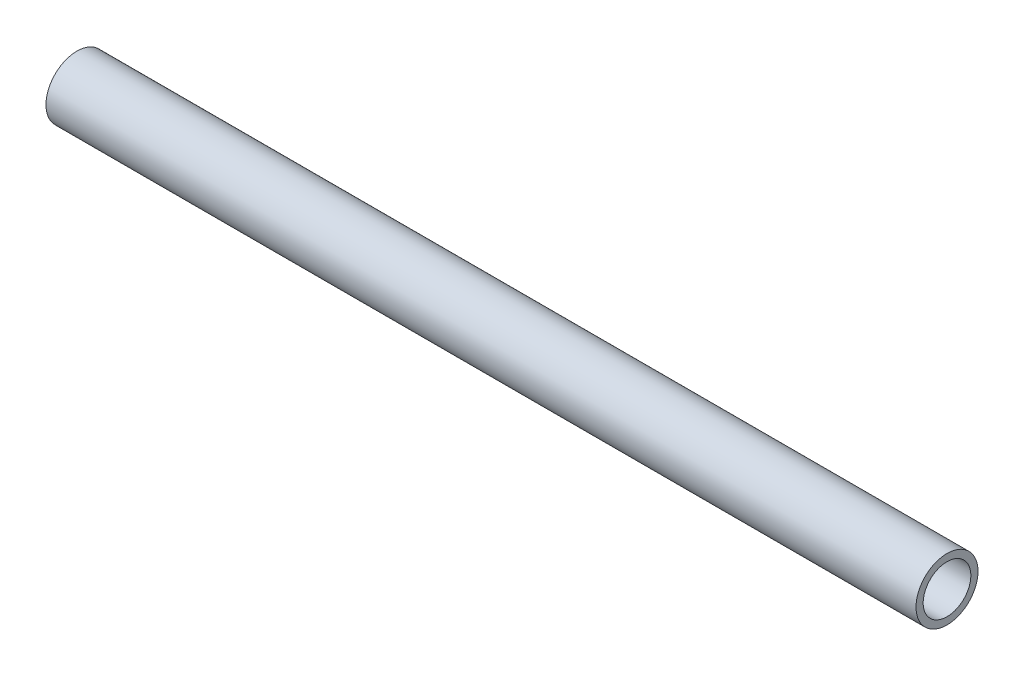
ISO-10303-21;
HEADER;
FILE_DESCRIPTION(('STEP AP214'),'2;1');
FILE_NAME('part.step','',(''),(''),'','','');
FILE_SCHEMA(('AUTOMOTIVE_DESIGN { 1 0 10303 214 1 1 1 1 }'));
ENDSEC;
DATA;
#1=APPLICATION_CONTEXT('core data for automotive mechanical design processes');
#2=APPLICATION_PROTOCOL_DEFINITION('international standard','automotive_design',2000,#1);
#3=PRODUCT_CONTEXT('',#1,'mechanical');
#4=PRODUCT('Part','Part','',(#3));
#5=PRODUCT_RELATED_PRODUCT_CATEGORY('part','',(#4));
#6=PRODUCT_DEFINITION_FORMATION('','',#4);
#7=PRODUCT_DEFINITION_CONTEXT('part definition',#1,'design');
#8=PRODUCT_DEFINITION('design','',#6,#7);
#9=PRODUCT_DEFINITION_SHAPE('','',#8);
#10=(LENGTH_UNIT() NAMED_UNIT(*) SI_UNIT(.MILLI.,.METRE.));
#11=(NAMED_UNIT(*) PLANE_ANGLE_UNIT() SI_UNIT($,.RADIAN.));
#12=(NAMED_UNIT(*) SI_UNIT($,.STERADIAN.) SOLID_ANGLE_UNIT());
#13=UNCERTAINTY_MEASURE_WITH_UNIT(LENGTH_MEASURE(1.E-05),#10,'distance_accuracy_value','');
#14=(GEOMETRIC_REPRESENTATION_CONTEXT(3) GLOBAL_UNCERTAINTY_ASSIGNED_CONTEXT((#13)) GLOBAL_UNIT_ASSIGNED_CONTEXT((#10,
#11,#12)) REPRESENTATION_CONTEXT('',''));
#15=CARTESIAN_POINT('',(0.,0.,0.));
#16=DIRECTION('',(0.,0.,1.));
#17=DIRECTION('',(1.,0.,0.));
#18=AXIS2_PLACEMENT_3D('',#15,#16,#17);
#19=CARTESIAN_POINT('',(463.55,0.,0.));
#20=DIRECTION('',(-1.,0.,0.));
#21=DIRECTION('',(0.,0.,1.));
#22=AXIS2_PLACEMENT_3D('',#19,#20,#21);
#23=CYLINDRICAL_SURFACE('',#22,12.7);
#24=CARTESIAN_POINT('',(463.55,0.,0.));
#25=DIRECTION('',(1.,0.,0.));
#26=DIRECTION('',(0.,0.,-1.));
#27=AXIS2_PLACEMENT_3D('',#24,#25,#26);
#28=CIRCLE('',#27,12.7);
#29=CARTESIAN_POINT('',(463.55,0.,-12.7));
#30=VERTEX_POINT('',#29);
#31=EDGE_CURVE('E45',#30,#30,#28,.T.);
#32=ORIENTED_EDGE('',*,*,#31,.T.);
#33=EDGE_LOOP('',(#32));
#34=FACE_BOUND('',#33,.T.);
#35=CARTESIAN_POINT('',(0.,0.,0.));
#36=DIRECTION('',(1.,0.,0.));
#37=DIRECTION('',(0.,0.,-1.));
#38=AXIS2_PLACEMENT_3D('',#35,#36,#37);
#39=CIRCLE('',#38,12.7);
#40=CARTESIAN_POINT('',(0.,0.,-12.7));
#41=VERTEX_POINT('',#40);
#42=EDGE_CURVE('E51',#41,#41,#39,.T.);
#43=ORIENTED_EDGE('',*,*,#42,.F.);
#44=EDGE_LOOP('',(#43));
#45=FACE_BOUND('',#44,.T.);
#46=ADVANCED_FACE('F38',(#34,#45),#23,.F.);
#47=CARTESIAN_POINT('',(463.55,0.,0.));
#48=DIRECTION('',(-1.,0.,0.));
#49=DIRECTION('',(0.,0.,1.));
#50=AXIS2_PLACEMENT_3D('',#47,#48,#49);
#51=CYLINDRICAL_SURFACE('',#50,16.51);
#52=CARTESIAN_POINT('',(463.55,0.,0.));
#53=DIRECTION('',(1.,0.,0.));
#54=DIRECTION('',(0.,0.,-1.));
#55=AXIS2_PLACEMENT_3D('',#52,#53,#54);
#56=CIRCLE('',#55,16.51);
#57=CARTESIAN_POINT('',(463.55,0.,-16.51));
#58=VERTEX_POINT('',#57);
#59=EDGE_CURVE('E10',#58,#58,#56,.T.);
#60=ORIENTED_EDGE('',*,*,#59,.F.);
#61=EDGE_LOOP('',(#60));
#62=FACE_BOUND('',#61,.T.);
#63=CARTESIAN_POINT('',(0.,0.,0.));
#64=DIRECTION('',(1.,0.,0.));
#65=DIRECTION('',(0.,0.,-1.));
#66=AXIS2_PLACEMENT_3D('',#63,#64,#65);
#67=CIRCLE('',#66,16.51);
#68=CARTESIAN_POINT('',(0.,0.,-16.51));
#69=VERTEX_POINT('',#68);
#70=EDGE_CURVE('E41',#69,#69,#67,.T.);
#71=ORIENTED_EDGE('',*,*,#70,.T.);
#72=EDGE_LOOP('',(#71));
#73=FACE_BOUND('',#72,.T.);
#74=ADVANCED_FACE('F58',(#62,#73),#51,.T.);
#75=CARTESIAN_POINT('',(463.55,0.,0.));
#76=DIRECTION('',(1.,0.,0.));
#77=DIRECTION('',(0.,0.,-1.));
#78=AXIS2_PLACEMENT_3D('',#75,#76,#77);
#79=PLANE('',#78);
#80=ORIENTED_EDGE('',*,*,#31,.F.);
#81=EDGE_LOOP('',(#80));
#82=FACE_BOUND('',#81,.T.);
#83=ORIENTED_EDGE('',*,*,#59,.T.);
#84=EDGE_LOOP('',(#83));
#85=FACE_BOUND('',#84,.T.);
#86=ADVANCED_FACE('F62',(#82,#85),#79,.T.);
#87=CARTESIAN_POINT('',(0.,0.,0.));
#88=DIRECTION('',(1.,0.,0.));
#89=DIRECTION('',(0.,0.,-1.));
#90=AXIS2_PLACEMENT_3D('',#87,#88,#89);
#91=PLANE('',#90);
#92=ORIENTED_EDGE('',*,*,#42,.T.);
#93=EDGE_LOOP('',(#92));
#94=FACE_BOUND('',#93,.T.);
#95=ORIENTED_EDGE('',*,*,#70,.F.);
#96=EDGE_LOOP('',(#95));
#97=FACE_BOUND('',#96,.T.);
#98=ADVANCED_FACE('F60',(#94,#97),#91,.F.);
#99=CLOSED_SHELL('',(#46,#74,#86,#98));
#100=MANIFOLD_SOLID_BREP('B2',#99);
#101=ADVANCED_BREP_SHAPE_REPRESENTATION('',(#18,#100),#14);
#102=SHAPE_DEFINITION_REPRESENTATION(#9,#101);
ENDSEC;
END-ISO-10303-21;
